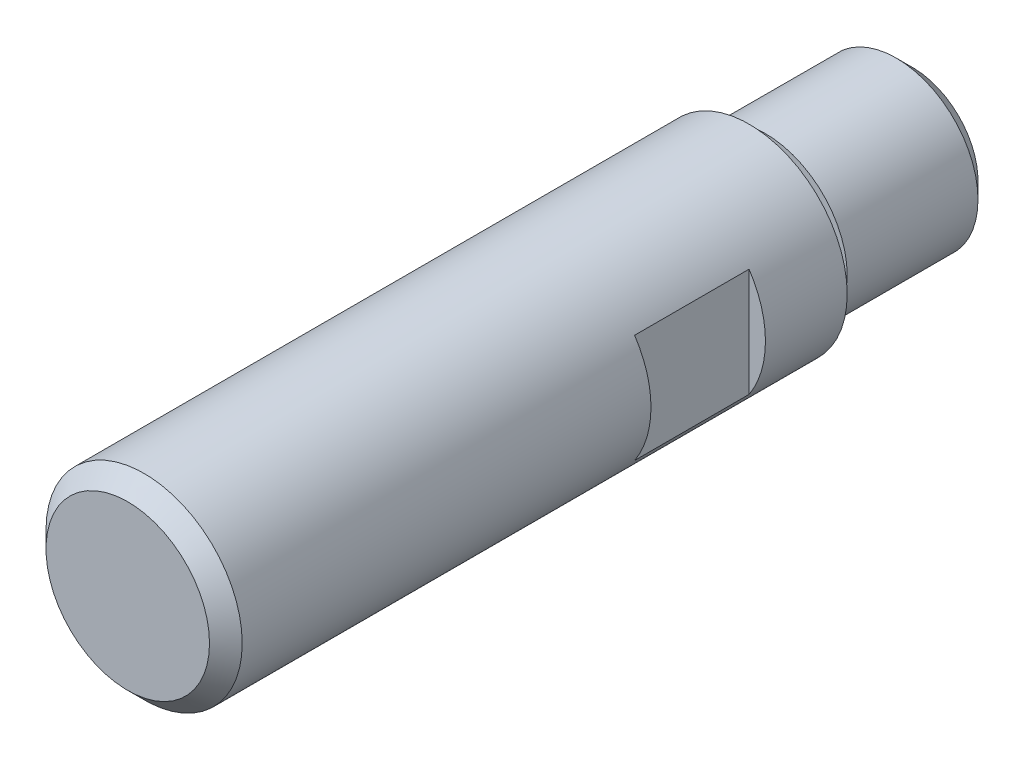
ISO-10303-21;
HEADER;
FILE_DESCRIPTION(('STEP AP214'),'2;1');
FILE_NAME('part.step','',(''),(''),'','','');
FILE_SCHEMA(('AUTOMOTIVE_DESIGN { 1 0 10303 214 1 1 1 1 }'));
ENDSEC;
DATA;
#1=APPLICATION_CONTEXT('core data for automotive mechanical design processes');
#2=APPLICATION_PROTOCOL_DEFINITION('international standard','automotive_design',2000,#1);
#3=PRODUCT_CONTEXT('',#1,'mechanical');
#4=PRODUCT('Part','Part','',(#3));
#5=PRODUCT_RELATED_PRODUCT_CATEGORY('part','',(#4));
#6=PRODUCT_DEFINITION_FORMATION('','',#4);
#7=PRODUCT_DEFINITION_CONTEXT('part definition',#1,'design');
#8=PRODUCT_DEFINITION('design','',#6,#7);
#9=PRODUCT_DEFINITION_SHAPE('','',#8);
#10=(LENGTH_UNIT() NAMED_UNIT(*) SI_UNIT(.MILLI.,.METRE.));
#11=(NAMED_UNIT(*) PLANE_ANGLE_UNIT() SI_UNIT($,.RADIAN.));
#12=(NAMED_UNIT(*) SI_UNIT($,.STERADIAN.) SOLID_ANGLE_UNIT());
#13=UNCERTAINTY_MEASURE_WITH_UNIT(LENGTH_MEASURE(1.E-05),#10,'distance_accuracy_value','');
#14=(GEOMETRIC_REPRESENTATION_CONTEXT(3) GLOBAL_UNCERTAINTY_ASSIGNED_CONTEXT((#13)) GLOBAL_UNIT_ASSIGNED_CONTEXT((#10,
#11,#12)) REPRESENTATION_CONTEXT('',''));
#15=CARTESIAN_POINT('',(0.,0.,0.));
#16=DIRECTION('',(0.,0.,1.));
#17=DIRECTION('',(1.,0.,0.));
#18=AXIS2_PLACEMENT_3D('',#15,#16,#17);
#19=CARTESIAN_POINT('',(0.,0.,-38.));
#20=DIRECTION('',(0.,0.,1.));
#21=DIRECTION('',(1.,0.,0.));
#22=AXIS2_PLACEMENT_3D('',#19,#20,#21);
#23=CYLINDRICAL_SURFACE('',#22,6.);
#24=CARTESIAN_POINT('',(0.,0.,-33.));
#25=DIRECTION('',(0.,0.,-1.));
#26=DIRECTION('',(-1.,0.,0.));
#27=AXIS2_PLACEMENT_3D('',#24,#25,#26);
#28=CIRCLE('',#27,6.);
#29=CARTESIAN_POINT('',(-5.,3.31662479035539,-33.));
#30=VERTEX_POINT('',#29);
#31=CARTESIAN_POINT('',(-5.,-3.31662479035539,-33.));
#32=VERTEX_POINT('',#31);
#33=EDGE_CURVE('E11',#30,#32,#28,.F.);
#34=ORIENTED_EDGE('',*,*,#33,.F.);
#35=DIRECTION('',(0.,0.,1.));
#36=VECTOR('',#35,1.);
#37=CARTESIAN_POINT('',(-5.00000000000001,3.31662479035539,-38.));
#38=LINE('',#37,#36);
#39=CARTESIAN_POINT('',(-5.,3.31662479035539,-26.));
#40=VERTEX_POINT('',#39);
#41=EDGE_CURVE('E49',#40,#30,#38,.F.);
#42=ORIENTED_EDGE('',*,*,#41,.F.);
#43=CARTESIAN_POINT('',(0.,0.,-26.));
#44=DIRECTION('',(0.,0.,1.));
#45=DIRECTION('',(1.,0.,0.));
#46=AXIS2_PLACEMENT_3D('',#43,#44,#45);
#47=CIRCLE('',#46,6.);
#48=CARTESIAN_POINT('',(-5.,-3.31662479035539,-26.));
#49=VERTEX_POINT('',#48);
#50=EDGE_CURVE('E79',#49,#40,#47,.F.);
#51=ORIENTED_EDGE('',*,*,#50,.F.);
#52=DIRECTION('',(0.,0.,1.));
#53=VECTOR('',#52,1.);
#54=CARTESIAN_POINT('',(-5.00000000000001,-3.31662479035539,-38.));
#55=LINE('',#54,#53);
#56=EDGE_CURVE('E85',#32,#49,#55,.T.);
#57=ORIENTED_EDGE('',*,*,#56,.F.);
#58=EDGE_LOOP('',(#34,#42,#51,#57));
#59=FACE_BOUND('',#58,.T.);
#60=CARTESIAN_POINT('',(0.,0.,-26.));
#61=DIRECTION('',(0.,0.,1.));
#62=DIRECTION('',(1.,0.,0.));
#63=AXIS2_PLACEMENT_3D('',#60,#61,#62);
#64=CIRCLE('',#63,6.);
#65=CARTESIAN_POINT('',(5.,3.31662479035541,-26.));
#66=VERTEX_POINT('',#65);
#67=CARTESIAN_POINT('',(5.,-3.31662479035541,-26.));
#68=VERTEX_POINT('',#67);
#69=EDGE_CURVE('E86',#66,#68,#64,.F.);
#70=ORIENTED_EDGE('',*,*,#69,.F.);
#71=DIRECTION('',(0.,0.,1.));
#72=VECTOR('',#71,1.);
#73=CARTESIAN_POINT('',(4.99999999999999,3.3166247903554,-38.));
#74=LINE('',#73,#72);
#75=CARTESIAN_POINT('',(5.,3.3166247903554,-33.));
#76=VERTEX_POINT('',#75);
#77=EDGE_CURVE('E106',#76,#66,#74,.T.);
#78=ORIENTED_EDGE('',*,*,#77,.F.);
#79=CARTESIAN_POINT('',(0.,0.,-33.));
#80=DIRECTION('',(0.,0.,-1.));
#81=DIRECTION('',(-1.,0.,0.));
#82=AXIS2_PLACEMENT_3D('',#79,#80,#81);
#83=CIRCLE('',#82,6.);
#84=CARTESIAN_POINT('',(5.,-3.3166247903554,-33.));
#85=VERTEX_POINT('',#84);
#86=EDGE_CURVE('E109',#85,#76,#83,.F.);
#87=ORIENTED_EDGE('',*,*,#86,.F.);
#88=DIRECTION('',(0.,0.,1.));
#89=VECTOR('',#88,1.);
#90=CARTESIAN_POINT('',(4.99999999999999,-3.3166247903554,-38.));
#91=LINE('',#90,#89);
#92=EDGE_CURVE('E103',#68,#85,#91,.F.);
#93=ORIENTED_EDGE('',*,*,#92,.F.);
#94=EDGE_LOOP('',(#70,#78,#87,#93));
#95=FACE_BOUND('',#94,.T.);
#96=CARTESIAN_POINT('',(0.,0.,-1.00000000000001));
#97=DIRECTION('',(0.,0.,1.));
#98=DIRECTION('',(1.,0.,0.));
#99=AXIS2_PLACEMENT_3D('',#96,#97,#98);
#100=CIRCLE('',#99,6.);
#101=CARTESIAN_POINT('',(6.,0.,-1.00000000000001));
#102=VERTEX_POINT('',#101);
#103=EDGE_CURVE('E126',#102,#102,#100,.F.);
#104=ORIENTED_EDGE('',*,*,#103,.T.);
#105=EDGE_LOOP('',(#104));
#106=FACE_BOUND('',#105,.T.);
#107=CARTESIAN_POINT('',(0.,0.,-38.));
#108=DIRECTION('',(0.,0.,1.));
#109=DIRECTION('',(1.,0.,0.));
#110=AXIS2_PLACEMENT_3D('',#107,#108,#109);
#111=CIRCLE('',#110,6.);
#112=CARTESIAN_POINT('',(6.,0.,-38.));
#113=VERTEX_POINT('',#112);
#114=EDGE_CURVE('E117',#113,#113,#111,.T.);
#115=ORIENTED_EDGE('',*,*,#114,.T.);
#116=EDGE_LOOP('',(#115));
#117=FACE_BOUND('',#116,.T.);
#118=ADVANCED_FACE('F40',(#59,#95,#106,#117),#23,.T.);
#119=CARTESIAN_POINT('',(0.,0.,-38.));
#120=DIRECTION('',(0.,0.,1.));
#121=DIRECTION('',(1.,0.,0.));
#122=AXIS2_PLACEMENT_3D('',#119,#120,#121);
#123=PLANE('',#122);
#124=ORIENTED_EDGE('',*,*,#114,.F.);
#125=EDGE_LOOP('',(#124));
#126=FACE_BOUND('',#125,.T.);
#127=CARTESIAN_POINT('',(0.,0.,-38.));
#128=DIRECTION('',(0.,0.,1.));
#129=DIRECTION('',(1.,0.,0.));
#130=AXIS2_PLACEMENT_3D('',#127,#128,#129);
#131=CIRCLE('',#130,4.27987728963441);
#132=CARTESIAN_POINT('',(4.27987728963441,0.,-38.));
#133=VERTEX_POINT('',#132);
#134=EDGE_CURVE('E140',#133,#133,#131,.T.);
#135=ORIENTED_EDGE('',*,*,#134,.T.);
#136=EDGE_LOOP('',(#135));
#137=FACE_BOUND('',#136,.T.);
#138=ADVANCED_FACE('F164',(#126,#137),#123,.F.);
#139=CARTESIAN_POINT('',(0.,0.,0.));
#140=DIRECTION('',(0.,0.,1.));
#141=DIRECTION('',(1.,0.,0.));
#142=AXIS2_PLACEMENT_3D('',#139,#140,#141);
#143=PLANE('',#142);
#144=CARTESIAN_POINT('',(0.,0.,0.));
#145=DIRECTION('',(0.,0.,1.));
#146=DIRECTION('',(1.,0.,0.));
#147=AXIS2_PLACEMENT_3D('',#144,#145,#146);
#148=CIRCLE('',#147,5.);
#149=CARTESIAN_POINT('',(5.,0.,0.));
#150=VERTEX_POINT('',#149);
#151=EDGE_CURVE('E130',#150,#150,#148,.T.);
#152=ORIENTED_EDGE('',*,*,#151,.T.);
#153=EDGE_LOOP('',(#152));
#154=FACE_BOUND('',#153,.T.);
#155=ADVANCED_FACE('F169',(#154),#143,.T.);
#156=CARTESIAN_POINT('',(0.,0.,0.));
#157=DIRECTION('',(0.,0.,-1.));
#158=DIRECTION('',(-1.,0.,0.));
#159=AXIS2_PLACEMENT_3D('',#156,#157,#158);
#160=CONICAL_SURFACE('',#159,5.,0.785398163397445);
#161=ORIENTED_EDGE('',*,*,#103,.F.);
#162=EDGE_LOOP('',(#161));
#163=FACE_BOUND('',#162,.T.);
#164=ORIENTED_EDGE('',*,*,#151,.F.);
#165=EDGE_LOOP('',(#164));
#166=FACE_BOUND('',#165,.T.);
#167=ADVANCED_FACE('F173',(#163,#166),#160,.T.);
#168=CARTESIAN_POINT('',(-5.02987728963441,0.,-39.));
#169=DIRECTION('',(0.,0.,1.));
#170=DIRECTION('',(1.,0.,0.));
#171=AXIS2_PLACEMENT_3D('',#168,#169,#170);
#172=PLANE('',#171);
#173=CARTESIAN_POINT('',(0.,0.,-39.));
#174=DIRECTION('',(0.,0.,1.));
#175=DIRECTION('',(1.,0.,0.));
#176=AXIS2_PLACEMENT_3D('',#173,#174,#175);
#177=CIRCLE('',#176,4.27987728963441);
#178=CARTESIAN_POINT('',(4.27987728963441,0.,-39.));
#179=VERTEX_POINT('',#178);
#180=EDGE_CURVE('E118',#179,#179,#177,.T.);
#181=ORIENTED_EDGE('',*,*,#180,.F.);
#182=EDGE_LOOP('',(#181));
#183=FACE_BOUND('',#182,.T.);
#184=CARTESIAN_POINT('',(0.,0.,-39.));
#185=DIRECTION('',(0.,0.,1.));
#186=DIRECTION('',(1.,0.,0.));
#187=AXIS2_PLACEMENT_3D('',#184,#185,#186);
#188=CIRCLE('',#187,5.);
#189=CARTESIAN_POINT('',(5.,0.,-39.));
#190=VERTEX_POINT('',#189);
#191=EDGE_CURVE('E113',#190,#190,#188,.T.);
#192=ORIENTED_EDGE('',*,*,#191,.T.);
#193=EDGE_LOOP('',(#192));
#194=FACE_BOUND('',#193,.T.);
#195=ADVANCED_FACE('F175',(#183,#194),#172,.T.);
#196=CARTESIAN_POINT('',(0.,0.,0.));
#197=DIRECTION('',(0.,0.,1.));
#198=DIRECTION('',(1.,0.,0.));
#199=AXIS2_PLACEMENT_3D('',#196,#197,#198);
#200=CYLINDRICAL_SURFACE('',#199,4.27987728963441);
#201=ORIENTED_EDGE('',*,*,#180,.T.);
#202=EDGE_LOOP('',(#201));
#203=FACE_BOUND('',#202,.T.);
#204=ORIENTED_EDGE('',*,*,#134,.F.);
#205=EDGE_LOOP('',(#204));
#206=FACE_BOUND('',#205,.T.);
#207=ADVANCED_FACE('F181',(#203,#206),#200,.T.);
#208=CARTESIAN_POINT('',(0.,0.,-48.));
#209=DIRECTION('',(0.,0.,-1.));
#210=DIRECTION('',(-1.,0.,0.));
#211=AXIS2_PLACEMENT_3D('',#208,#209,#210);
#212=PLANE('',#211);
#213=CARTESIAN_POINT('',(0.,0.,-48.));
#214=DIRECTION('',(0.,0.,-1.));
#215=DIRECTION('',(-1.,0.,0.));
#216=AXIS2_PLACEMENT_3D('',#213,#214,#215);
#217=CIRCLE('',#216,4.);
#218=CARTESIAN_POINT('',(-4.,0.,-48.));
#219=VERTEX_POINT('',#218);
#220=EDGE_CURVE('E122',#219,#219,#217,.T.);
#221=ORIENTED_EDGE('',*,*,#220,.T.);
#222=EDGE_LOOP('',(#221));
#223=FACE_BOUND('',#222,.T.);
#224=ADVANCED_FACE('F195',(#223),#212,.T.);
#225=CARTESIAN_POINT('',(0.,0.,-48.));
#226=DIRECTION('',(0.,0.,1.));
#227=DIRECTION('',(1.,0.,0.));
#228=AXIS2_PLACEMENT_3D('',#225,#226,#227);
#229=CONICAL_SURFACE('',#228,4.,0.785398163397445);
#230=CARTESIAN_POINT('',(0.,0.,-47.));
#231=DIRECTION('',(0.,0.,-1.));
#232=DIRECTION('',(-1.,0.,0.));
#233=AXIS2_PLACEMENT_3D('',#230,#231,#232);
#234=CIRCLE('',#233,5.);
#235=CARTESIAN_POINT('',(-5.,0.,-47.));
#236=VERTEX_POINT('',#235);
#237=EDGE_CURVE('E112',#236,#236,#234,.F.);
#238=ORIENTED_EDGE('',*,*,#237,.F.);
#239=EDGE_LOOP('',(#238));
#240=FACE_BOUND('',#239,.T.);
#241=ORIENTED_EDGE('',*,*,#220,.F.);
#242=EDGE_LOOP('',(#241));
#243=FACE_BOUND('',#242,.T.);
#244=ADVANCED_FACE('F42',(#240,#243),#229,.T.);
#245=CARTESIAN_POINT('',(0.,0.,-48.));
#246=DIRECTION('',(0.,0.,1.));
#247=DIRECTION('',(1.,0.,0.));
#248=AXIS2_PLACEMENT_3D('',#245,#246,#247);
#249=CYLINDRICAL_SURFACE('',#248,5.);
#250=ORIENTED_EDGE('',*,*,#237,.T.);
#251=EDGE_LOOP('',(#250));
#252=FACE_BOUND('',#251,.T.);
#253=ORIENTED_EDGE('',*,*,#191,.F.);
#254=EDGE_LOOP('',(#253));
#255=FACE_BOUND('',#254,.T.);
#256=ADVANCED_FACE('F205',(#252,#255),#249,.T.);
#257=CARTESIAN_POINT('',(12.2581777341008,-9.,-26.));
#258=DIRECTION('',(0.,0.,1.));
#259=DIRECTION('',(1.,0.,0.));
#260=AXIS2_PLACEMENT_3D('',#257,#258,#259);
#261=PLANE('',#260);
#262=ORIENTED_EDGE('',*,*,#69,.T.);
#263=DIRECTION('',(0.,1.,0.));
#264=VECTOR('',#263,1.);
#265=CARTESIAN_POINT('',(5.,-9.,-26.));
#266=LINE('',#265,#264);
#267=EDGE_CURVE('E144',#68,#66,#266,.T.);
#268=ORIENTED_EDGE('',*,*,#267,.T.);
#269=EDGE_LOOP('',(#262,#268));
#270=FACE_BOUND('',#269,.T.);
#271=ADVANCED_FACE('F207',(#270),#261,.F.);
#272=CARTESIAN_POINT('',(5.,-9.,-33.));
#273=DIRECTION('',(-1.,0.,0.));
#274=DIRECTION('',(0.,0.,1.));
#275=AXIS2_PLACEMENT_3D('',#272,#273,#274);
#276=PLANE('',#275);
#277=ORIENTED_EDGE('',*,*,#92,.T.);
#278=DIRECTION('',(0.,1.,0.));
#279=VECTOR('',#278,1.);
#280=CARTESIAN_POINT('',(5.,-9.,-33.));
#281=LINE('',#280,#279);
#282=EDGE_CURVE('E62',#85,#76,#281,.T.);
#283=ORIENTED_EDGE('',*,*,#282,.T.);
#284=ORIENTED_EDGE('',*,*,#77,.T.);
#285=ORIENTED_EDGE('',*,*,#267,.F.);
#286=EDGE_LOOP('',(#277,#283,#284,#285));
#287=FACE_BOUND('',#286,.T.);
#288=ADVANCED_FACE('F161',(#287),#276,.F.);
#289=CARTESIAN_POINT('',(12.2581777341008,-9.,-33.));
#290=DIRECTION('',(0.,0.,-1.));
#291=DIRECTION('',(-1.,0.,0.));
#292=AXIS2_PLACEMENT_3D('',#289,#290,#291);
#293=PLANE('',#292);
#294=ORIENTED_EDGE('',*,*,#86,.T.);
#295=ORIENTED_EDGE('',*,*,#282,.F.);
#296=EDGE_LOOP('',(#294,#295));
#297=FACE_BOUND('',#296,.T.);
#298=ADVANCED_FACE('F154',(#297),#293,.F.);
#299=CARTESIAN_POINT('',(-20.887344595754,-9.,-33.));
#300=DIRECTION('',(0.,0.,-1.));
#301=DIRECTION('',(-1.,0.,0.));
#302=AXIS2_PLACEMENT_3D('',#299,#300,#301);
#303=PLANE('',#302);
#304=ORIENTED_EDGE('',*,*,#33,.T.);
#305=DIRECTION('',(0.,1.,0.));
#306=VECTOR('',#305,1.);
#307=CARTESIAN_POINT('',(-5.,-9.,-33.));
#308=LINE('',#307,#306);
#309=EDGE_CURVE('E93',#32,#30,#308,.T.);
#310=ORIENTED_EDGE('',*,*,#309,.T.);
#311=EDGE_LOOP('',(#304,#310));
#312=FACE_BOUND('',#311,.T.);
#313=ADVANCED_FACE('F152',(#312),#303,.F.);
#314=CARTESIAN_POINT('',(-5.,-9.,-33.));
#315=DIRECTION('',(1.,0.,0.));
#316=DIRECTION('',(0.,0.,-1.));
#317=AXIS2_PLACEMENT_3D('',#314,#315,#316);
#318=PLANE('',#317);
#319=ORIENTED_EDGE('',*,*,#41,.T.);
#320=ORIENTED_EDGE('',*,*,#309,.F.);
#321=ORIENTED_EDGE('',*,*,#56,.T.);
#322=DIRECTION('',(0.,1.,0.));
#323=VECTOR('',#322,1.);
#324=CARTESIAN_POINT('',(-5.,-9.,-26.));
#325=LINE('',#324,#323);
#326=EDGE_CURVE('E55',#49,#40,#325,.T.);
#327=ORIENTED_EDGE('',*,*,#326,.T.);
#328=EDGE_LOOP('',(#319,#320,#321,#327));
#329=FACE_BOUND('',#328,.T.);
#330=ADVANCED_FACE('F89',(#329),#318,.F.);
#331=CARTESIAN_POINT('',(-20.887344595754,-9.,-26.));
#332=DIRECTION('',(0.,0.,1.));
#333=DIRECTION('',(1.,0.,0.));
#334=AXIS2_PLACEMENT_3D('',#331,#332,#333);
#335=PLANE('',#334);
#336=ORIENTED_EDGE('',*,*,#50,.T.);
#337=ORIENTED_EDGE('',*,*,#326,.F.);
#338=EDGE_LOOP('',(#336,#337));
#339=FACE_BOUND('',#338,.T.);
#340=ADVANCED_FACE('F80',(#339),#335,.F.);
#341=CLOSED_SHELL('',(#118,#138,#155,#167,#195,#207,#224,#244,#256,#271,#288,#298,#313,#330,#340));
#342=MANIFOLD_SOLID_BREP('B2',#341);
#343=ADVANCED_BREP_SHAPE_REPRESENTATION('',(#18,#342),#14);
#344=SHAPE_DEFINITION_REPRESENTATION(#9,#343);
ENDSEC;
END-ISO-10303-21;
